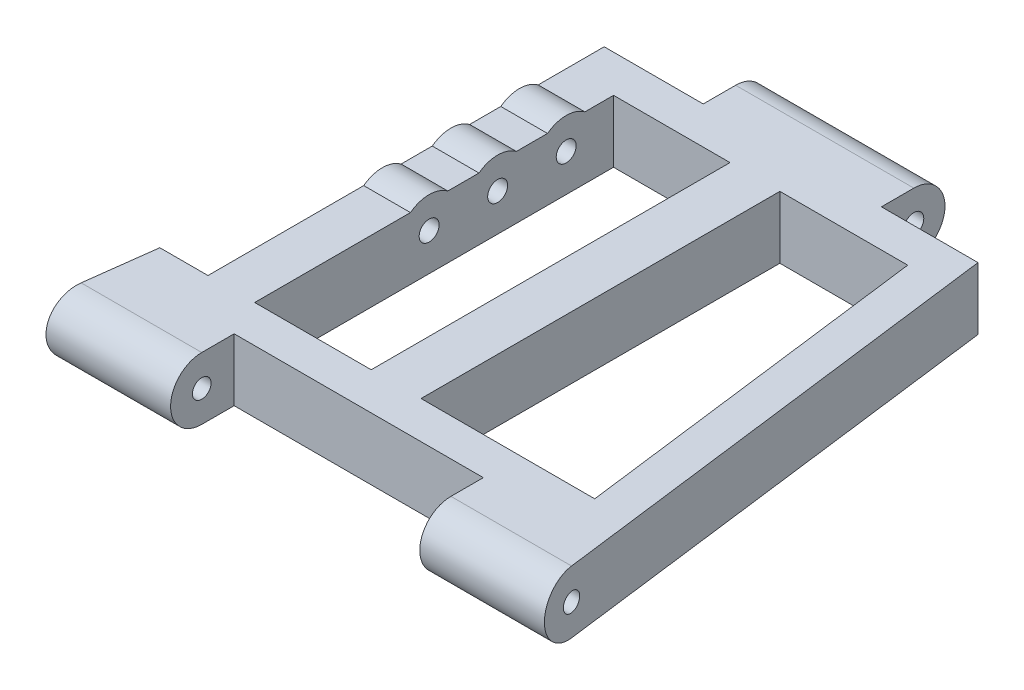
from build123d import *

# Parameters (mm, degrees)
SKETCH_1_W               = 18.7
SKETCH_1_H               = 57.6
EXTRUDE_1_DEPTH          = 10
SKETCH_2_R               = 1.6
CUT_EXTRUDE_1_DEPTH      = 28.6
CUT_EXTRUDE_2_DEPTH      = 123.489842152
CUT_EXTRUDE_2_DEPTH_BACK = 123.489842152
SKETCH_3_R               = 1.5
SKETCH_4_R               = 1.6
CUT_EXTRUDE_3_DEPTH      = 7.5
EXTRUDE_2_DEPTH          = 7.5


with BuildPart() as part:
    # Sketch 1 → Extrude 1 (new body)
    with BuildSketch(Plane(origin=(0, 0, 0), x_dir=(1, 0, 0), z_dir=(0, 1, 0))):
        Polygon((-129.73752184, 96.119148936), (-129.73752184, 32.519148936), (-137.46752184, 32.519148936), (-139.53752184, 16.319148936), (-119.53752184, 16.319148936), (-119.53752184, 26.519148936), (-79.53752184, 26.519148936), (-79.53752184, 16.319148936), (-59.53752184, 16.319148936), (-69.734188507, 96.119148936), (-85.23752184, 96.119148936), (-85.23752184, 106.319148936), (-113.83752184, 106.319148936), (-113.83752184, 96.119148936), align=None)
        Polygon((-75.016305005, 90.119148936), (-67.656305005, 32.519148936), (-95.53752184, 32.519148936), (-95.53752184, 90.119148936), align=None, mode=Mode.SUBTRACT)
        with Locations((-112.88752184, 61.319148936)):
            Rectangle(SKETCH_1_W, SKETCH_1_H, mode=Mode.SUBTRACT)
    extrude(amount=EXTRUDE_1_DEPTH)

    # Sketch 2 → Cut-Extrude 1 (cut)
    with BuildSketch(Plane.ZY.offset(113.83752184)):
        with Locations((-101.319148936, 5)):
            Circle(SKETCH_2_R)
        with BuildLine():
            Line((-106.319148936, 10), (-106.319148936, 5))
            ThreePointArc((-106.319148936, 5), (-104.854682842, 8.535533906), (-101.319148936, 10))
            Line((-101.319148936, 10), (-106.319148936, 10))
        make_face()
        with BuildLine():
            Line((-106.319148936, 5), (-106.319148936, 0))
            Line((-106.319148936, 0), (-101.319148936, 0))
            ThreePointArc((-101.319148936, 0), (-104.854682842, 1.464466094), (-106.319148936, 5))
        make_face()
    extrude(amount=-CUT_EXTRUDE_1_DEPTH, mode=Mode.SUBTRACT)

    # Sketch 3 → Cut-Extrude 2 (cut, two sides: drawn at the far end of the back side and taken through both)
    with BuildSketch(Plane.ZY.offset(79.53752184).offset(-CUT_EXTRUDE_2_DEPTH_BACK)):
        with Locations(Location((-21.319148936, 5, 0), (0, 0, 180))):
            Circle(SKETCH_3_R)
        with BuildLine():
            Line((-16.319148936, 10), (-21.319148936, 10))
            ThreePointArc((-21.319148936, 10), (-17.78361503, 8.535533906), (-16.319148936, 5))
            Line((-16.319148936, 5), (-16.319148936, 10))
        make_face()
        with BuildLine():
            ThreePointArc((-16.319148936, 5), (-17.78361503, 1.464466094), (-21.319148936, 0))
            Line((-21.319148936, 0), (-16.319148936, 0))
            Line((-16.319148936, 0), (-16.319148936, 5))
        make_face()
    extrude(amount=CUT_EXTRUDE_2_DEPTH + CUT_EXTRUDE_2_DEPTH_BACK, mode=Mode.SUBTRACT)

    # Sketch 4 → Cut-Extrude 3 (cut)
    with BuildSketch(Plane.ZY.offset(129.73752184)):
        with Locations((-60.519148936, 6)):
            Circle(SKETCH_4_R)
        with Locations((-71.519148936, 6)):
            Circle(SKETCH_4_R)
        with Locations((-82.519148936, 6)):
            Circle(SKETCH_4_R)
    extrude(amount=-CUT_EXTRUDE_3_DEPTH, mode=Mode.SUBTRACT)

    # Sketch 4_3 → Extrude 2 (add)
    with BuildSketch(Plane.ZY.offset(129.73752184)):
        with BuildLine():
            Line((-63.519148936, 10), (-57.519148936, 10))
            ThreePointArc((-57.519148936, 10), (-60.519148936, 11), (-63.519148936, 10))
        make_face()
        with BuildLine():
            ThreePointArc((-68.519148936, 10), (-71.519148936, 11), (-74.519148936, 10))
            Line((-74.519148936, 10), (-68.519148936, 10))
        make_face()
        with BuildLine():
            ThreePointArc((-79.519148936, 10), (-82.519148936, 11), (-85.519148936, 10))
            Line((-85.519148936, 10), (-79.519148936, 10))
        make_face()
    extrude(amount=-EXTRUDE_2_DEPTH)


solid = part.part
